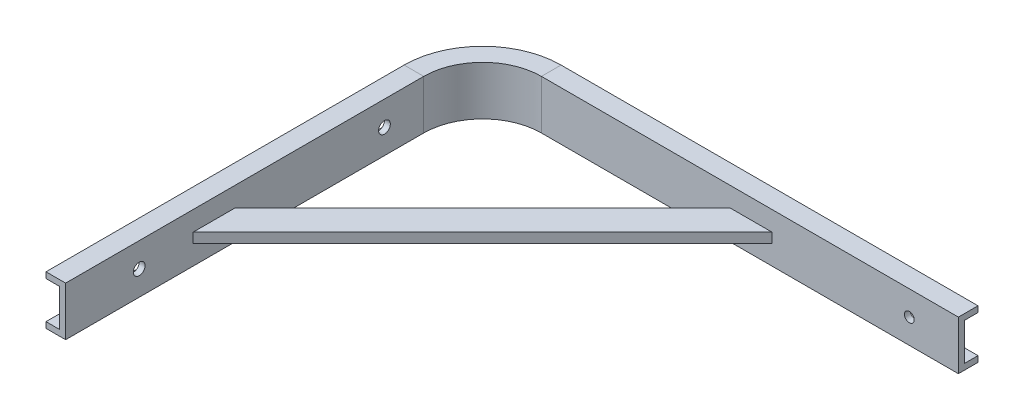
ISO-10303-21;
HEADER;
FILE_DESCRIPTION(('STEP AP214'),'2;1');
FILE_NAME('part.step','',(''),(''),'','','');
FILE_SCHEMA(('AUTOMOTIVE_DESIGN { 1 0 10303 214 1 1 1 1 }'));
ENDSEC;
DATA;
#1=APPLICATION_CONTEXT('core data for automotive mechanical design processes');
#2=APPLICATION_PROTOCOL_DEFINITION('international standard','automotive_design',2000,#1);
#3=PRODUCT_CONTEXT('',#1,'mechanical');
#4=PRODUCT('Part','Part','',(#3));
#5=PRODUCT_RELATED_PRODUCT_CATEGORY('part','',(#4));
#6=PRODUCT_DEFINITION_FORMATION('','',#4);
#7=PRODUCT_DEFINITION_CONTEXT('part definition',#1,'design');
#8=PRODUCT_DEFINITION('design','',#6,#7);
#9=PRODUCT_DEFINITION_SHAPE('','',#8);
#10=(LENGTH_UNIT() NAMED_UNIT(*) SI_UNIT(.MILLI.,.METRE.));
#11=(NAMED_UNIT(*) PLANE_ANGLE_UNIT() SI_UNIT($,.RADIAN.));
#12=(NAMED_UNIT(*) SI_UNIT($,.STERADIAN.) SOLID_ANGLE_UNIT());
#13=UNCERTAINTY_MEASURE_WITH_UNIT(LENGTH_MEASURE(1.E-05),#10,'distance_accuracy_value','');
#14=(GEOMETRIC_REPRESENTATION_CONTEXT(3) GLOBAL_UNCERTAINTY_ASSIGNED_CONTEXT((#13)) GLOBAL_UNIT_ASSIGNED_CONTEXT((#10,
#11,#12)) REPRESENTATION_CONTEXT('',''));
#15=CARTESIAN_POINT('',(0.,0.,0.));
#16=DIRECTION('',(0.,0.,1.));
#17=DIRECTION('',(1.,0.,0.));
#18=AXIS2_PLACEMENT_3D('',#15,#16,#17);
#19=CARTESIAN_POINT('',(-242.51106428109,-12.4999999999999,-227.488935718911));
#20=DIRECTION('',(-1.,0.,0.));
#21=DIRECTION('',(0.,0.,1.));
#22=AXIS2_PLACEMENT_3D('',#19,#20,#21);
#23=PLANE('',#22);
#24=CARTESIAN_POINT('',(-242.51106428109,0.,60.0000000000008));
#25=DIRECTION('',(1.,0.,0.));
#26=DIRECTION('',(0.,0.,-1.));
#27=AXIS2_PLACEMENT_3D('',#24,#25,#26);
#28=CIRCLE('',#27,3.00000000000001);
#29=CARTESIAN_POINT('',(-242.51106428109,0.,57.0000000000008));
#30=VERTEX_POINT('',#29);
#31=EDGE_CURVE('E254',#30,#30,#28,.T.);
#32=ORIENTED_EDGE('',*,*,#31,.F.);
#33=EDGE_LOOP('',(#32));
#34=FACE_BOUND('',#33,.T.);
#35=DIRECTION('',(0.,-1.,0.));
#36=VECTOR('',#35,1.);
#37=CARTESIAN_POINT('',(-242.511064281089,-12.4999999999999,40.0000000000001));
#38=LINE('',#37,#36);
#39=CARTESIAN_POINT('',(-242.511064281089,12.5,40.0000000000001));
#40=VERTEX_POINT('',#39);
#41=CARTESIAN_POINT('',(-242.511064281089,-12.5,40.0000000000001));
#42=VERTEX_POINT('',#41);
#43=EDGE_CURVE('E330',#40,#42,#38,.T.);
#44=ORIENTED_EDGE('',*,*,#43,.F.);
#45=DIRECTION('',(0.,0.,1.));
#46=VECTOR('',#45,1.);
#47=CARTESIAN_POINT('',(-242.51106428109,12.4999999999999,-227.488935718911));
#48=LINE('',#47,#46);
#49=CARTESIAN_POINT('',(-242.511064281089,12.5,222.511064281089));
#50=VERTEX_POINT('',#49);
#51=EDGE_CURVE('E312',#40,#50,#48,.T.);
#52=ORIENTED_EDGE('',*,*,#51,.T.);
#53=DIRECTION('',(0.,-1.,0.));
#54=VECTOR('',#53,1.);
#55=CARTESIAN_POINT('',(-242.511064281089,12.5,222.511064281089));
#56=LINE('',#55,#54);
#57=CARTESIAN_POINT('',(-242.511064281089,-12.5,222.511064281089));
#58=VERTEX_POINT('',#57);
#59=EDGE_CURVE('E309',#50,#58,#56,.T.);
#60=ORIENTED_EDGE('',*,*,#59,.T.);
#61=DIRECTION('',(0.,0.,-1.));
#62=VECTOR('',#61,1.);
#63=CARTESIAN_POINT('',(-242.51106428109,-12.4999999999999,-227.488935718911));
#64=LINE('',#63,#62);
#65=EDGE_CURVE('E311',#58,#42,#64,.T.);
#66=ORIENTED_EDGE('',*,*,#65,.T.);
#67=EDGE_LOOP('',(#44,#52,#60,#66));
#68=FACE_BOUND('',#67,.T.);
#69=CARTESIAN_POINT('',(-242.511064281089,0.,185.000000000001));
#70=DIRECTION('',(1.,0.,0.));
#71=DIRECTION('',(0.,0.,-1.));
#72=AXIS2_PLACEMENT_3D('',#69,#70,#71);
#73=CIRCLE('',#72,2.99999999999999);
#74=CARTESIAN_POINT('',(-242.511064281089,0.,182.000000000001));
#75=VERTEX_POINT('',#74);
#76=EDGE_CURVE('E257',#75,#75,#73,.T.);
#77=ORIENTED_EDGE('',*,*,#76,.F.);
#78=EDGE_LOOP('',(#77));
#79=FACE_BOUND('',#78,.T.);
#80=DIRECTION('',(0.,0.,1.));
#81=VECTOR('',#80,1.);
#82=CARTESIAN_POINT('',(-242.511064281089,2.5,157.511064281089));
#83=LINE('',#82,#81);
#84=CARTESIAN_POINT('',(-242.511064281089,2.5,136.297860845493));
#85=VERTEX_POINT('',#84);
#86=CARTESIAN_POINT('',(-242.511064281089,2.5,157.511064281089));
#87=VERTEX_POINT('',#86);
#88=EDGE_CURVE('E180',#85,#87,#83,.T.);
#89=ORIENTED_EDGE('',*,*,#88,.F.);
#90=DIRECTION('',(0.,-1.,0.));
#91=VECTOR('',#90,1.);
#92=CARTESIAN_POINT('',(-242.511064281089,2.5,136.297860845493));
#93=LINE('',#92,#91);
#94=CARTESIAN_POINT('',(-242.511064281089,-2.5,136.297860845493));
#95=VERTEX_POINT('',#94);
#96=EDGE_CURVE('E433',#85,#95,#93,.T.);
#97=ORIENTED_EDGE('',*,*,#96,.T.);
#98=DIRECTION('',(0.,0.,1.));
#99=VECTOR('',#98,1.);
#100=CARTESIAN_POINT('',(-242.511064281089,-2.5,157.511064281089));
#101=LINE('',#100,#99);
#102=CARTESIAN_POINT('',(-242.511064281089,-2.5,157.511064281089));
#103=VERTEX_POINT('',#102);
#104=EDGE_CURVE('E191',#95,#103,#101,.T.);
#105=ORIENTED_EDGE('',*,*,#104,.T.);
#106=DIRECTION('',(0.,-1.,0.));
#107=VECTOR('',#106,1.);
#108=CARTESIAN_POINT('',(-242.511064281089,2.5,157.511064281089));
#109=LINE('',#108,#107);
#110=EDGE_CURVE('E51',#87,#103,#109,.T.);
#111=ORIENTED_EDGE('',*,*,#110,.F.);
#112=EDGE_LOOP('',(#89,#97,#105,#111));
#113=FACE_BOUND('',#112,.T.);
#114=ADVANCED_FACE('F34',(#34,#68,#79,#113),#23,.F.);
#115=CARTESIAN_POINT('',(0.,-12.4999999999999,10.));
#116=DIRECTION('',(0.,0.,-1.));
#117=DIRECTION('',(-1.,0.,0.));
#118=AXIS2_PLACEMENT_3D('',#115,#116,#117);
#119=PLANE('',#118);
#120=DIRECTION('',(-1.,0.,0.));
#121=VECTOR('',#120,1.);
#122=CARTESIAN_POINT('',(0.,12.4999999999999,10.));
#123=LINE('',#122,#121);
#124=CARTESIAN_POINT('',(0.,12.4999999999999,10.));
#125=VERTEX_POINT('',#124);
#126=CARTESIAN_POINT('',(-212.511064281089,12.5,9.99999999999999));
#127=VERTEX_POINT('',#126);
#128=EDGE_CURVE('E296',#125,#127,#123,.T.);
#129=ORIENTED_EDGE('',*,*,#128,.T.);
#130=DIRECTION('',(0.,-1.,0.));
#131=VECTOR('',#130,1.);
#132=CARTESIAN_POINT('',(-212.511064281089,-12.4999999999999,10.));
#133=LINE('',#132,#131);
#134=CARTESIAN_POINT('',(-212.511064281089,-12.5,9.99999999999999));
#135=VERTEX_POINT('',#134);
#136=EDGE_CURVE('E293',#127,#135,#133,.T.);
#137=ORIENTED_EDGE('',*,*,#136,.T.);
#138=DIRECTION('',(1.,0.,0.));
#139=VECTOR('',#138,1.);
#140=CARTESIAN_POINT('',(0.,-12.4999999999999,10.));
#141=LINE('',#140,#139);
#142=CARTESIAN_POINT('',(0.,-12.4999999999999,10.));
#143=VERTEX_POINT('',#142);
#144=EDGE_CURVE('E291',#135,#143,#141,.T.);
#145=ORIENTED_EDGE('',*,*,#144,.T.);
#146=DIRECTION('',(0.,1.,0.));
#147=VECTOR('',#146,1.);
#148=CARTESIAN_POINT('',(0.,12.4999999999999,10.));
#149=LINE('',#148,#147);
#150=EDGE_CURVE('E288',#143,#125,#149,.T.);
#151=ORIENTED_EDGE('',*,*,#150,.T.);
#152=EDGE_LOOP('',(#129,#137,#145,#151));
#153=FACE_BOUND('',#152,.T.);
#154=CARTESIAN_POINT('',(-25.,0.,10.));
#155=DIRECTION('',(0.,0.,1.));
#156=DIRECTION('',(1.,0.,0.));
#157=AXIS2_PLACEMENT_3D('',#154,#155,#156);
#158=CIRCLE('',#157,2.5);
#159=CARTESIAN_POINT('',(-22.5,0.,10.));
#160=VERTEX_POINT('',#159);
#161=EDGE_CURVE('E251',#160,#160,#158,.T.);
#162=ORIENTED_EDGE('',*,*,#161,.F.);
#163=EDGE_LOOP('',(#162));
#164=FACE_BOUND('',#163,.T.);
#165=DIRECTION('',(-1.,0.,0.));
#166=VECTOR('',#165,1.);
#167=CARTESIAN_POINT('',(-116.213203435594,2.5,10.));
#168=LINE('',#167,#166);
#169=CARTESIAN_POINT('',(-94.9999999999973,2.5,10.));
#170=VERTEX_POINT('',#169);
#171=CARTESIAN_POINT('',(-116.213203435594,2.5,10.));
#172=VERTEX_POINT('',#171);
#173=EDGE_CURVE('E179',#170,#172,#168,.T.);
#174=ORIENTED_EDGE('',*,*,#173,.F.);
#175=DIRECTION('',(0.,-1.,0.));
#176=VECTOR('',#175,1.);
#177=CARTESIAN_POINT('',(-94.9999999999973,2.5,10.));
#178=LINE('',#177,#176);
#179=CARTESIAN_POINT('',(-94.9999999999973,-2.5,10.));
#180=VERTEX_POINT('',#179);
#181=EDGE_CURVE('E176',#170,#180,#178,.T.);
#182=ORIENTED_EDGE('',*,*,#181,.T.);
#183=DIRECTION('',(-1.,0.,0.));
#184=VECTOR('',#183,1.);
#185=CARTESIAN_POINT('',(-116.213203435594,-2.5,10.));
#186=LINE('',#185,#184);
#187=CARTESIAN_POINT('',(-116.213203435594,-2.5,10.));
#188=VERTEX_POINT('',#187);
#189=EDGE_CURVE('E439',#180,#188,#186,.T.);
#190=ORIENTED_EDGE('',*,*,#189,.T.);
#191=DIRECTION('',(0.,-1.,0.));
#192=VECTOR('',#191,1.);
#193=CARTESIAN_POINT('',(-116.213203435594,2.5,10.));
#194=LINE('',#193,#192);
#195=EDGE_CURVE('E196',#172,#188,#194,.T.);
#196=ORIENTED_EDGE('',*,*,#195,.F.);
#197=EDGE_LOOP('',(#174,#182,#190,#196));
#198=FACE_BOUND('',#197,.T.);
#199=ADVANCED_FACE('F424',(#153,#164,#198),#119,.F.);
#200=CARTESIAN_POINT('',(-252.51106428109,-12.4999999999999,-227.488935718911));
#201=DIRECTION('',(-1.,0.,0.));
#202=DIRECTION('',(0.,0.,1.));
#203=AXIS2_PLACEMENT_3D('',#200,#201,#202);
#204=PLANE('',#203);
#205=DIRECTION('',(0.,-1.,0.));
#206=VECTOR('',#205,1.);
#207=CARTESIAN_POINT('',(-252.511064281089,12.5,222.511064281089));
#208=LINE('',#207,#206);
#209=CARTESIAN_POINT('',(-252.511064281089,-9.5,222.511064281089));
#210=VERTEX_POINT('',#209);
#211=CARTESIAN_POINT('',(-252.511064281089,-12.5,222.511064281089));
#212=VERTEX_POINT('',#211);
#213=EDGE_CURVE('E317',#210,#212,#208,.T.);
#214=ORIENTED_EDGE('',*,*,#213,.F.);
#215=DIRECTION('',(0.,0.,1.));
#216=VECTOR('',#215,1.);
#217=CARTESIAN_POINT('',(-252.511064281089,-9.5,40.0000000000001));
#218=LINE('',#217,#216);
#219=CARTESIAN_POINT('',(-252.511064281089,-9.5,40.0000000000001));
#220=VERTEX_POINT('',#219);
#221=EDGE_CURVE('E194',#220,#210,#218,.T.);
#222=ORIENTED_EDGE('',*,*,#221,.F.);
#223=DIRECTION('',(0.,-1.,0.));
#224=VECTOR('',#223,1.);
#225=CARTESIAN_POINT('',(-252.511064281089,-12.4999999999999,40.0000000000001));
#226=LINE('',#225,#224);
#227=CARTESIAN_POINT('',(-252.511064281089,-12.5,40.0000000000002));
#228=VERTEX_POINT('',#227);
#229=EDGE_CURVE('E43',#220,#228,#226,.T.);
#230=ORIENTED_EDGE('',*,*,#229,.T.);
#231=DIRECTION('',(0.,0.,-1.));
#232=VECTOR('',#231,1.);
#233=CARTESIAN_POINT('',(-252.51106428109,-12.4999999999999,-227.488935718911));
#234=LINE('',#233,#232);
#235=EDGE_CURVE('E316',#212,#228,#234,.T.);
#236=ORIENTED_EDGE('',*,*,#235,.F.);
#237=EDGE_LOOP('',(#214,#222,#230,#236));
#238=FACE_BOUND('',#237,.T.);
#239=ADVANCED_FACE('F398',(#238),#204,.T.);
#240=CARTESIAN_POINT('',(0.,-12.4999999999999,0.));
#241=DIRECTION('',(0.,0.,-1.));
#242=DIRECTION('',(-1.,0.,0.));
#243=AXIS2_PLACEMENT_3D('',#240,#241,#242);
#244=PLANE('',#243);
#245=DIRECTION('',(0.,-1.,0.));
#246=VECTOR('',#245,1.);
#247=CARTESIAN_POINT('',(-212.511064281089,-12.4999999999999,0.));
#248=LINE('',#247,#246);
#249=CARTESIAN_POINT('',(-212.511064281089,-9.50000000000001,0.));
#250=VERTEX_POINT('',#249);
#251=CARTESIAN_POINT('',(-212.511064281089,-12.5,0.));
#252=VERTEX_POINT('',#251);
#253=EDGE_CURVE('E264',#250,#252,#248,.T.);
#254=ORIENTED_EDGE('',*,*,#253,.F.);
#255=DIRECTION('',(-1.,0.,0.));
#256=VECTOR('',#255,1.);
#257=CARTESIAN_POINT('',(0.,-9.5,0.));
#258=LINE('',#257,#256);
#259=CARTESIAN_POINT('',(0.,-9.5,0.));
#260=VERTEX_POINT('',#259);
#261=EDGE_CURVE('E215',#260,#250,#258,.T.);
#262=ORIENTED_EDGE('',*,*,#261,.F.);
#263=DIRECTION('',(0.,1.,0.));
#264=VECTOR('',#263,1.);
#265=CARTESIAN_POINT('',(0.,12.4999999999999,0.));
#266=LINE('',#265,#264);
#267=CARTESIAN_POINT('',(0.,-12.4999999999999,0.));
#268=VERTEX_POINT('',#267);
#269=EDGE_CURVE('E302',#268,#260,#266,.T.);
#270=ORIENTED_EDGE('',*,*,#269,.F.);
#271=DIRECTION('',(1.,0.,0.));
#272=VECTOR('',#271,1.);
#273=CARTESIAN_POINT('',(0.,-12.4999999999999,0.));
#274=LINE('',#273,#272);
#275=EDGE_CURVE('E283',#252,#268,#274,.T.);
#276=ORIENTED_EDGE('',*,*,#275,.F.);
#277=EDGE_LOOP('',(#254,#262,#270,#276));
#278=FACE_BOUND('',#277,.T.);
#279=ADVANCED_FACE('F414',(#278),#244,.T.);
#280=CARTESIAN_POINT('',(-212.511064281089,463.304835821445,40.));
#281=DIRECTION('',(0.,-1.,0.));
#282=DIRECTION('',(0.,0.,-1.));
#283=AXIS2_PLACEMENT_3D('',#280,#281,#282);
#284=CYLINDRICAL_SURFACE('',#283,40.);
#285=ORIENTED_EDGE('',*,*,#229,.F.);
#286=CARTESIAN_POINT('',(-212.511064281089,-9.5,40.));
#287=DIRECTION('',(0.,1.,0.));
#288=DIRECTION('',(0.,0.,1.));
#289=AXIS2_PLACEMENT_3D('',#286,#287,#288);
#290=CIRCLE('',#289,40.);
#291=EDGE_CURVE('E192',#250,#220,#290,.T.);
#292=ORIENTED_EDGE('',*,*,#291,.F.);
#293=ORIENTED_EDGE('',*,*,#253,.T.);
#294=CARTESIAN_POINT('',(-212.511064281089,-12.5,40.));
#295=DIRECTION('',(0.,-1.,0.));
#296=DIRECTION('',(0.,0.,-1.));
#297=AXIS2_PLACEMENT_3D('',#294,#295,#296);
#298=CIRCLE('',#297,40.);
#299=EDGE_CURVE('E261',#228,#252,#298,.T.);
#300=ORIENTED_EDGE('',*,*,#299,.F.);
#301=EDGE_LOOP('',(#285,#292,#293,#300));
#302=FACE_BOUND('',#301,.T.);
#303=ADVANCED_FACE('F408',(#302),#284,.T.);
#304=CARTESIAN_POINT('',(-252.511064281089,0.,185.000000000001));
#305=DIRECTION('',(1.,0.,0.));
#306=DIRECTION('',(0.,0.,-1.));
#307=AXIS2_PLACEMENT_3D('',#304,#305,#306);
#308=CYLINDRICAL_SURFACE('',#307,2.99999999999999);
#309=ORIENTED_EDGE('',*,*,#76,.T.);
#310=EDGE_LOOP('',(#309));
#311=FACE_BOUND('',#310,.T.);
#312=CARTESIAN_POINT('',(-245.511064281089,0.,185.000000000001));
#313=DIRECTION('',(-1.,0.,0.));
#314=DIRECTION('',(0.,0.,1.));
#315=AXIS2_PLACEMENT_3D('',#312,#313,#314);
#316=CIRCLE('',#315,2.99999999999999);
#317=CARTESIAN_POINT('',(-245.511064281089,0.,188.000000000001));
#318=VERTEX_POINT('',#317);
#319=EDGE_CURVE('E248',#318,#318,#316,.T.);
#320=ORIENTED_EDGE('',*,*,#319,.T.);
#321=EDGE_LOOP('',(#320));
#322=FACE_BOUND('',#321,.T.);
#323=ADVANCED_FACE('F480',(#311,#322),#308,.F.);
#324=CARTESIAN_POINT('',(-252.51106428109,0.,60.0000000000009));
#325=DIRECTION('',(1.,0.,0.));
#326=DIRECTION('',(0.,0.,-1.));
#327=AXIS2_PLACEMENT_3D('',#324,#325,#326);
#328=CYLINDRICAL_SURFACE('',#327,3.00000000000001);
#329=ORIENTED_EDGE('',*,*,#31,.T.);
#330=EDGE_LOOP('',(#329));
#331=FACE_BOUND('',#330,.T.);
#332=CARTESIAN_POINT('',(-245.511064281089,0.,60.0000000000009));
#333=DIRECTION('',(-1.,0.,0.));
#334=DIRECTION('',(0.,0.,1.));
#335=AXIS2_PLACEMENT_3D('',#332,#333,#334);
#336=CIRCLE('',#335,3.00000000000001);
#337=CARTESIAN_POINT('',(-245.511064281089,0.,63.0000000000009));
#338=VERTEX_POINT('',#337);
#339=EDGE_CURVE('E38',#338,#338,#336,.T.);
#340=ORIENTED_EDGE('',*,*,#339,.T.);
#341=EDGE_LOOP('',(#340));
#342=FACE_BOUND('',#341,.T.);
#343=ADVANCED_FACE('F344',(#331,#342),#328,.F.);
#344=CARTESIAN_POINT('',(-25.,0.,0.));
#345=DIRECTION('',(0.,0.,1.));
#346=DIRECTION('',(1.,0.,0.));
#347=AXIS2_PLACEMENT_3D('',#344,#345,#346);
#348=CYLINDRICAL_SURFACE('',#347,2.5);
#349=ORIENTED_EDGE('',*,*,#161,.T.);
#350=EDGE_LOOP('',(#349));
#351=FACE_BOUND('',#350,.T.);
#352=CARTESIAN_POINT('',(-25.,0.,7.));
#353=DIRECTION('',(0.,0.,-1.));
#354=DIRECTION('',(-1.,0.,0.));
#355=AXIS2_PLACEMENT_3D('',#352,#353,#354);
#356=CIRCLE('',#355,2.5);
#357=CARTESIAN_POINT('',(-27.5,0.,7.));
#358=VERTEX_POINT('',#357);
#359=EDGE_CURVE('E247',#358,#358,#356,.F.);
#360=ORIENTED_EDGE('',*,*,#359,.F.);
#361=EDGE_LOOP('',(#360));
#362=FACE_BOUND('',#361,.T.);
#363=ADVANCED_FACE('F464',(#351,#362),#348,.F.);
#364=DIRECTION('',(0.,0.,1.));
#365=VECTOR('',#364,1.);
#366=CARTESIAN_POINT('',(-252.511064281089,9.5,40.0000000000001));
#367=LINE('',#366,#365);
#368=CARTESIAN_POINT('',(-252.511064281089,9.5,40.0000000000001));
#369=VERTEX_POINT('',#368);
#370=CARTESIAN_POINT('',(-252.511064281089,9.5,222.511064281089));
#371=VERTEX_POINT('',#370);
#372=EDGE_CURVE('E220',#369,#371,#367,.T.);
#373=ORIENTED_EDGE('',*,*,#372,.T.);
#374=CARTESIAN_POINT('',(-252.511064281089,12.5,222.511064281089));
#375=VERTEX_POINT('',#374);
#376=EDGE_CURVE('E313',#375,#371,#208,.T.);
#377=ORIENTED_EDGE('',*,*,#376,.F.);
#378=DIRECTION('',(0.,0.,1.));
#379=VECTOR('',#378,1.);
#380=CARTESIAN_POINT('',(-252.51106428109,12.4999999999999,-227.488935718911));
#381=LINE('',#380,#379);
#382=CARTESIAN_POINT('',(-252.511064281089,12.5,40.0000000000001));
#383=VERTEX_POINT('',#382);
#384=EDGE_CURVE('E276',#383,#375,#381,.T.);
#385=ORIENTED_EDGE('',*,*,#384,.F.);
#386=EDGE_CURVE('E11',#383,#369,#226,.T.);
#387=ORIENTED_EDGE('',*,*,#386,.T.);
#388=EDGE_LOOP('',(#373,#377,#385,#387));
#389=FACE_BOUND('',#388,.T.);
#390=ADVANCED_FACE('F367',(#389),#204,.T.);
#391=CARTESIAN_POINT('',(-242.51106428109,12.4999999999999,-227.488935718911));
#392=DIRECTION('',(0.,-1.,0.));
#393=DIRECTION('',(0.,0.,-1.));
#394=AXIS2_PLACEMENT_3D('',#391,#392,#393);
#395=PLANE('',#394);
#396=DIRECTION('',(1.,0.,0.));
#397=VECTOR('',#396,1.);
#398=CARTESIAN_POINT('',(-242.511064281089,12.5,40.0000000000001));
#399=LINE('',#398,#397);
#400=EDGE_CURVE('E324',#383,#40,#399,.T.);
#401=ORIENTED_EDGE('',*,*,#400,.F.);
#402=ORIENTED_EDGE('',*,*,#384,.T.);
#403=DIRECTION('',(-1.,0.,0.));
#404=VECTOR('',#403,1.);
#405=CARTESIAN_POINT('',(-242.511064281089,12.5,222.511064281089));
#406=LINE('',#405,#404);
#407=EDGE_CURVE('E321',#50,#375,#406,.T.);
#408=ORIENTED_EDGE('',*,*,#407,.F.);
#409=ORIENTED_EDGE('',*,*,#51,.F.);
#410=EDGE_LOOP('',(#401,#402,#408,#409));
#411=FACE_BOUND('',#410,.T.);
#412=ADVANCED_FACE('F36',(#411),#395,.F.);
#413=CARTESIAN_POINT('',(-242.511064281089,12.5,222.511064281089));
#414=DIRECTION('',(0.,0.,-1.));
#415=DIRECTION('',(-1.,0.,0.));
#416=AXIS2_PLACEMENT_3D('',#413,#414,#415);
#417=PLANE('',#416);
#418=ORIENTED_EDGE('',*,*,#376,.T.);
#419=DIRECTION('',(1.,0.,0.));
#420=VECTOR('',#419,1.);
#421=CARTESIAN_POINT('',(-245.511064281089,9.5,222.511064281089));
#422=LINE('',#421,#420);
#423=CARTESIAN_POINT('',(-245.511064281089,9.5,222.511064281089));
#424=VERTEX_POINT('',#423);
#425=EDGE_CURVE('E223',#371,#424,#422,.T.);
#426=ORIENTED_EDGE('',*,*,#425,.T.);
#427=DIRECTION('',(0.,-1.,0.));
#428=VECTOR('',#427,1.);
#429=CARTESIAN_POINT('',(-245.511064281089,9.5,222.511064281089));
#430=LINE('',#429,#428);
#431=CARTESIAN_POINT('',(-245.511064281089,-9.5,222.511064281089));
#432=VERTEX_POINT('',#431);
#433=EDGE_CURVE('E244',#424,#432,#430,.T.);
#434=ORIENTED_EDGE('',*,*,#433,.T.);
#435=DIRECTION('',(1.,0.,0.));
#436=VECTOR('',#435,1.);
#437=CARTESIAN_POINT('',(-245.511064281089,-9.5,222.511064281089));
#438=LINE('',#437,#436);
#439=EDGE_CURVE('E201',#210,#432,#438,.T.);
#440=ORIENTED_EDGE('',*,*,#439,.F.);
#441=ORIENTED_EDGE('',*,*,#213,.T.);
#442=DIRECTION('',(-1.,0.,0.));
#443=VECTOR('',#442,1.);
#444=CARTESIAN_POINT('',(-242.511064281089,-12.5,222.511064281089));
#445=LINE('',#444,#443);
#446=EDGE_CURVE('E318',#58,#212,#445,.T.);
#447=ORIENTED_EDGE('',*,*,#446,.F.);
#448=ORIENTED_EDGE('',*,*,#59,.F.);
#449=ORIENTED_EDGE('',*,*,#407,.T.);
#450=EDGE_LOOP('',(#418,#426,#434,#440,#441,#447,#448,#449));
#451=FACE_BOUND('',#450,.T.);
#452=ADVANCED_FACE('F361',(#451),#417,.F.);
#453=CARTESIAN_POINT('',(-242.51106428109,-12.4999999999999,-227.488935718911));
#454=DIRECTION('',(0.,1.,0.));
#455=DIRECTION('',(0.,0.,1.));
#456=AXIS2_PLACEMENT_3D('',#453,#454,#455);
#457=PLANE('',#456);
#458=DIRECTION('',(-1.,0.,0.));
#459=VECTOR('',#458,1.);
#460=CARTESIAN_POINT('',(-242.511064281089,-12.5,40.0000000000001));
#461=LINE('',#460,#459);
#462=EDGE_CURVE('E327',#42,#228,#461,.T.);
#463=ORIENTED_EDGE('',*,*,#462,.F.);
#464=ORIENTED_EDGE('',*,*,#65,.F.);
#465=ORIENTED_EDGE('',*,*,#446,.T.);
#466=ORIENTED_EDGE('',*,*,#235,.T.);
#467=EDGE_LOOP('',(#463,#464,#465,#466));
#468=FACE_BOUND('',#467,.T.);
#469=ADVANCED_FACE('F401',(#468),#457,.F.);
#470=CARTESIAN_POINT('',(0.,12.4999999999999,10.));
#471=DIRECTION('',(-1.,0.,0.));
#472=DIRECTION('',(0.,0.,1.));
#473=AXIS2_PLACEMENT_3D('',#470,#471,#472);
#474=PLANE('',#473);
#475=DIRECTION('',(0.,-1.,0.));
#476=VECTOR('',#475,1.);
#477=CARTESIAN_POINT('',(0.,9.5,7.));
#478=LINE('',#477,#476);
#479=CARTESIAN_POINT('',(0.,9.5,7.));
#480=VERTEX_POINT('',#479);
#481=CARTESIAN_POINT('',(0.,-9.5,7.));
#482=VERTEX_POINT('',#481);
#483=EDGE_CURVE('E238',#480,#482,#478,.T.);
#484=ORIENTED_EDGE('',*,*,#483,.F.);
#485=DIRECTION('',(0.,0.,-1.));
#486=VECTOR('',#485,1.);
#487=CARTESIAN_POINT('',(0.,9.5,0.));
#488=LINE('',#487,#486);
#489=CARTESIAN_POINT('',(0.,9.5,0.));
#490=VERTEX_POINT('',#489);
#491=EDGE_CURVE('E232',#480,#490,#488,.T.);
#492=ORIENTED_EDGE('',*,*,#491,.T.);
#493=CARTESIAN_POINT('',(0.,12.4999999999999,0.));
#494=VERTEX_POINT('',#493);
#495=EDGE_CURVE('E305',#490,#494,#266,.T.);
#496=ORIENTED_EDGE('',*,*,#495,.T.);
#497=DIRECTION('',(0.,0.,-1.));
#498=VECTOR('',#497,1.);
#499=CARTESIAN_POINT('',(0.,12.4999999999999,10.));
#500=LINE('',#499,#498);
#501=EDGE_CURVE('E273',#125,#494,#500,.T.);
#502=ORIENTED_EDGE('',*,*,#501,.F.);
#503=ORIENTED_EDGE('',*,*,#150,.F.);
#504=DIRECTION('',(0.,0.,-1.));
#505=VECTOR('',#504,1.);
#506=CARTESIAN_POINT('',(0.,-12.4999999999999,10.));
#507=LINE('',#506,#505);
#508=EDGE_CURVE('E299',#143,#268,#507,.T.);
#509=ORIENTED_EDGE('',*,*,#508,.T.);
#510=ORIENTED_EDGE('',*,*,#269,.T.);
#511=DIRECTION('',(0.,0.,-1.));
#512=VECTOR('',#511,1.);
#513=CARTESIAN_POINT('',(0.,-9.5,0.));
#514=LINE('',#513,#512);
#515=EDGE_CURVE('E213',#482,#260,#514,.T.);
#516=ORIENTED_EDGE('',*,*,#515,.F.);
#517=EDGE_LOOP('',(#484,#492,#496,#502,#503,#509,#510,#516));
#518=FACE_BOUND('',#517,.T.);
#519=ADVANCED_FACE('F383',(#518),#474,.F.);
#520=CARTESIAN_POINT('',(0.,-12.4999999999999,10.));
#521=DIRECTION('',(0.,1.,0.));
#522=DIRECTION('',(-1.,0.,0.));
#523=AXIS2_PLACEMENT_3D('',#520,#521,#522);
#524=PLANE('',#523);
#525=ORIENTED_EDGE('',*,*,#144,.F.);
#526=DIRECTION('',(0.,0.,-1.));
#527=VECTOR('',#526,1.);
#528=CARTESIAN_POINT('',(-212.511064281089,-12.5,10.));
#529=LINE('',#528,#527);
#530=EDGE_CURVE('E285',#135,#252,#529,.T.);
#531=ORIENTED_EDGE('',*,*,#530,.T.);
#532=ORIENTED_EDGE('',*,*,#275,.T.);
#533=ORIENTED_EDGE('',*,*,#508,.F.);
#534=EDGE_LOOP('',(#525,#531,#532,#533));
#535=FACE_BOUND('',#534,.T.);
#536=ADVANCED_FACE('F419',(#535),#524,.F.);
#537=DIRECTION('',(-1.,0.,0.));
#538=VECTOR('',#537,1.);
#539=CARTESIAN_POINT('',(0.,9.5,0.));
#540=LINE('',#539,#538);
#541=CARTESIAN_POINT('',(-212.511064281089,9.5,0.));
#542=VERTEX_POINT('',#541);
#543=EDGE_CURVE('E235',#490,#542,#540,.T.);
#544=ORIENTED_EDGE('',*,*,#543,.T.);
#545=CARTESIAN_POINT('',(-212.511064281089,12.5,0.));
#546=VERTEX_POINT('',#545);
#547=EDGE_CURVE('E306',#546,#542,#248,.T.);
#548=ORIENTED_EDGE('',*,*,#547,.F.);
#549=DIRECTION('',(-1.,0.,0.));
#550=VECTOR('',#549,1.);
#551=CARTESIAN_POINT('',(0.,12.4999999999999,0.));
#552=LINE('',#551,#550);
#553=EDGE_CURVE('E280',#494,#546,#552,.T.);
#554=ORIENTED_EDGE('',*,*,#553,.F.);
#555=ORIENTED_EDGE('',*,*,#495,.F.);
#556=EDGE_LOOP('',(#544,#548,#554,#555));
#557=FACE_BOUND('',#556,.T.);
#558=ADVANCED_FACE('F375',(#557),#244,.T.);
#559=CARTESIAN_POINT('',(0.,12.4999999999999,10.));
#560=DIRECTION('',(0.,-1.,0.));
#561=DIRECTION('',(1.,0.,0.));
#562=AXIS2_PLACEMENT_3D('',#559,#560,#561);
#563=PLANE('',#562);
#564=ORIENTED_EDGE('',*,*,#553,.T.);
#565=DIRECTION('',(0.,0.,1.));
#566=VECTOR('',#565,1.);
#567=CARTESIAN_POINT('',(-212.511064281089,12.5,10.));
#568=LINE('',#567,#566);
#569=EDGE_CURVE('E277',#546,#127,#568,.T.);
#570=ORIENTED_EDGE('',*,*,#569,.T.);
#571=ORIENTED_EDGE('',*,*,#128,.F.);
#572=ORIENTED_EDGE('',*,*,#501,.T.);
#573=EDGE_LOOP('',(#564,#570,#571,#572));
#574=FACE_BOUND('',#573,.T.);
#575=ADVANCED_FACE('F378',(#574),#563,.F.);
#576=CARTESIAN_POINT('',(-212.511064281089,12.5,40.));
#577=DIRECTION('',(0.,-1.,0.));
#578=DIRECTION('',(1.,0.,0.));
#579=AXIS2_PLACEMENT_3D('',#576,#577,#578);
#580=PLANE('',#579);
#581=ORIENTED_EDGE('',*,*,#400,.T.);
#582=CARTESIAN_POINT('',(-212.511064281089,12.5,40.));
#583=DIRECTION('',(0.,-1.,0.));
#584=DIRECTION('',(0.,0.,-1.));
#585=AXIS2_PLACEMENT_3D('',#582,#583,#584);
#586=CIRCLE('',#585,30.);
#587=EDGE_CURVE('E260',#127,#40,#586,.F.);
#588=ORIENTED_EDGE('',*,*,#587,.F.);
#589=ORIENTED_EDGE('',*,*,#569,.F.);
#590=CARTESIAN_POINT('',(-212.511064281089,12.5,40.));
#591=DIRECTION('',(0.,-1.,0.));
#592=DIRECTION('',(0.,0.,-1.));
#593=AXIS2_PLACEMENT_3D('',#590,#591,#592);
#594=CIRCLE('',#593,40.);
#595=EDGE_CURVE('E265',#546,#383,#594,.F.);
#596=ORIENTED_EDGE('',*,*,#595,.T.);
#597=EDGE_LOOP('',(#581,#588,#589,#596));
#598=FACE_BOUND('',#597,.T.);
#599=ADVANCED_FACE('F488',(#598),#580,.F.);
#600=CARTESIAN_POINT('',(-212.511064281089,-12.5,40.));
#601=DIRECTION('',(0.,1.,0.));
#602=DIRECTION('',(-1.,0.,0.));
#603=AXIS2_PLACEMENT_3D('',#600,#601,#602);
#604=PLANE('',#603);
#605=ORIENTED_EDGE('',*,*,#530,.F.);
#606=CARTESIAN_POINT('',(-212.511064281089,-12.5,40.));
#607=DIRECTION('',(0.,-1.,0.));
#608=DIRECTION('',(0.,0.,-1.));
#609=AXIS2_PLACEMENT_3D('',#606,#607,#608);
#610=CIRCLE('',#609,30.);
#611=EDGE_CURVE('E268',#42,#135,#610,.T.);
#612=ORIENTED_EDGE('',*,*,#611,.F.);
#613=ORIENTED_EDGE('',*,*,#462,.T.);
#614=ORIENTED_EDGE('',*,*,#299,.T.);
#615=EDGE_LOOP('',(#605,#612,#613,#614));
#616=FACE_BOUND('',#615,.T.);
#617=ADVANCED_FACE('F406',(#616),#604,.F.);
#618=CARTESIAN_POINT('',(-212.511064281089,9.5,40.));
#619=DIRECTION('',(0.,1.,0.));
#620=DIRECTION('',(0.,0.,1.));
#621=AXIS2_PLACEMENT_3D('',#618,#619,#620);
#622=CIRCLE('',#621,40.);
#623=EDGE_CURVE('E217',#542,#369,#622,.T.);
#624=ORIENTED_EDGE('',*,*,#623,.T.);
#625=ORIENTED_EDGE('',*,*,#386,.F.);
#626=ORIENTED_EDGE('',*,*,#595,.F.);
#627=ORIENTED_EDGE('',*,*,#547,.T.);
#628=EDGE_LOOP('',(#624,#625,#626,#627));
#629=FACE_BOUND('',#628,.T.);
#630=ADVANCED_FACE('F370',(#629),#284,.T.);
#631=CARTESIAN_POINT('',(-212.511064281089,463.304835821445,40.));
#632=DIRECTION('',(0.,-1.,0.));
#633=DIRECTION('',(0.,0.,-1.));
#634=AXIS2_PLACEMENT_3D('',#631,#632,#633);
#635=CYLINDRICAL_SURFACE('',#634,30.);
#636=ORIENTED_EDGE('',*,*,#611,.T.);
#637=ORIENTED_EDGE('',*,*,#136,.F.);
#638=ORIENTED_EDGE('',*,*,#587,.T.);
#639=ORIENTED_EDGE('',*,*,#43,.T.);
#640=EDGE_LOOP('',(#636,#637,#638,#639));
#641=FACE_BOUND('',#640,.T.);
#642=ADVANCED_FACE('F421',(#641),#635,.F.);
#643=CARTESIAN_POINT('',(0.,9.5,7.));
#644=DIRECTION('',(0.,0.,-1.));
#645=DIRECTION('',(-1.,0.,0.));
#646=AXIS2_PLACEMENT_3D('',#643,#644,#645);
#647=PLANE('',#646);
#648=DIRECTION('',(0.,-1.,0.));
#649=VECTOR('',#648,1.);
#650=CARTESIAN_POINT('',(-212.511064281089,9.5,7.));
#651=LINE('',#650,#649);
#652=CARTESIAN_POINT('',(-212.511064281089,9.5,7.));
#653=VERTEX_POINT('',#652);
#654=CARTESIAN_POINT('',(-212.511064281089,-9.5,7.));
#655=VERTEX_POINT('',#654);
#656=EDGE_CURVE('E240',#653,#655,#651,.T.);
#657=ORIENTED_EDGE('',*,*,#656,.F.);
#658=DIRECTION('',(1.,0.,0.));
#659=VECTOR('',#658,1.);
#660=CARTESIAN_POINT('',(0.,9.5,7.));
#661=LINE('',#660,#659);
#662=EDGE_CURVE('E230',#653,#480,#661,.T.);
#663=ORIENTED_EDGE('',*,*,#662,.T.);
#664=ORIENTED_EDGE('',*,*,#483,.T.);
#665=DIRECTION('',(1.,0.,0.));
#666=VECTOR('',#665,1.);
#667=CARTESIAN_POINT('',(0.,-9.5,7.));
#668=LINE('',#667,#666);
#669=EDGE_CURVE('E210',#655,#482,#668,.T.);
#670=ORIENTED_EDGE('',*,*,#669,.F.);
#671=EDGE_LOOP('',(#657,#663,#664,#670));
#672=FACE_BOUND('',#671,.T.);
#673=ORIENTED_EDGE('',*,*,#359,.T.);
#674=EDGE_LOOP('',(#673));
#675=FACE_BOUND('',#674,.T.);
#676=ADVANCED_FACE('F350',(#672,#675),#647,.T.);
#677=CARTESIAN_POINT('',(-245.511064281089,9.5,40.0000000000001));
#678=DIRECTION('',(-1.,0.,0.));
#679=DIRECTION('',(0.,0.,1.));
#680=AXIS2_PLACEMENT_3D('',#677,#678,#679);
#681=PLANE('',#680);
#682=ORIENTED_EDGE('',*,*,#319,.F.);
#683=EDGE_LOOP('',(#682));
#684=FACE_BOUND('',#683,.T.);
#685=ORIENTED_EDGE('',*,*,#339,.F.);
#686=EDGE_LOOP('',(#685));
#687=FACE_BOUND('',#686,.T.);
#688=ORIENTED_EDGE('',*,*,#433,.F.);
#689=DIRECTION('',(0.,0.,-1.));
#690=VECTOR('',#689,1.);
#691=CARTESIAN_POINT('',(-245.511064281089,9.5,40.0000000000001));
#692=LINE('',#691,#690);
#693=CARTESIAN_POINT('',(-245.511064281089,9.5,40.0000000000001));
#694=VERTEX_POINT('',#693);
#695=EDGE_CURVE('E226',#424,#694,#692,.T.);
#696=ORIENTED_EDGE('',*,*,#695,.T.);
#697=DIRECTION('',(0.,-1.,0.));
#698=VECTOR('',#697,1.);
#699=CARTESIAN_POINT('',(-245.511064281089,9.5,40.0000000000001));
#700=LINE('',#699,#698);
#701=CARTESIAN_POINT('',(-245.511064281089,-9.5,40.0000000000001));
#702=VERTEX_POINT('',#701);
#703=EDGE_CURVE('E242',#694,#702,#700,.T.);
#704=ORIENTED_EDGE('',*,*,#703,.T.);
#705=DIRECTION('',(0.,0.,-1.));
#706=VECTOR('',#705,1.);
#707=CARTESIAN_POINT('',(-245.511064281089,-9.5,40.0000000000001));
#708=LINE('',#707,#706);
#709=EDGE_CURVE('E204',#432,#702,#708,.T.);
#710=ORIENTED_EDGE('',*,*,#709,.F.);
#711=EDGE_LOOP('',(#688,#696,#704,#710));
#712=FACE_BOUND('',#711,.T.);
#713=ADVANCED_FACE('F346',(#684,#687,#712),#681,.T.);
#714=CARTESIAN_POINT('',(-212.511064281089,9.5,40.));
#715=DIRECTION('',(0.,-1.,0.));
#716=DIRECTION('',(0.,0.,-1.));
#717=AXIS2_PLACEMENT_3D('',#714,#715,#716);
#718=CYLINDRICAL_SURFACE('',#717,33.);
#719=ORIENTED_EDGE('',*,*,#703,.F.);
#720=CARTESIAN_POINT('',(-212.511064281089,9.5,40.));
#721=DIRECTION('',(0.,-1.,0.));
#722=DIRECTION('',(0.,0.,1.));
#723=AXIS2_PLACEMENT_3D('',#720,#721,#722);
#724=CIRCLE('',#723,33.);
#725=EDGE_CURVE('E228',#694,#653,#724,.T.);
#726=ORIENTED_EDGE('',*,*,#725,.T.);
#727=ORIENTED_EDGE('',*,*,#656,.T.);
#728=CARTESIAN_POINT('',(-212.511064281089,-9.5,40.));
#729=DIRECTION('',(0.,-1.,0.));
#730=DIRECTION('',(0.,0.,1.));
#731=AXIS2_PLACEMENT_3D('',#728,#729,#730);
#732=CIRCLE('',#731,33.);
#733=EDGE_CURVE('E207',#702,#655,#732,.T.);
#734=ORIENTED_EDGE('',*,*,#733,.F.);
#735=EDGE_LOOP('',(#719,#726,#727,#734));
#736=FACE_BOUND('',#735,.T.);
#737=ADVANCED_FACE('F349',(#736),#718,.T.);
#738=CARTESIAN_POINT('',(-212.511064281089,9.5,40.));
#739=DIRECTION('',(0.,1.,0.));
#740=DIRECTION('',(0.,0.,1.));
#741=AXIS2_PLACEMENT_3D('',#738,#739,#740);
#742=PLANE('',#741);
#743=ORIENTED_EDGE('',*,*,#623,.F.);
#744=ORIENTED_EDGE('',*,*,#543,.F.);
#745=ORIENTED_EDGE('',*,*,#491,.F.);
#746=ORIENTED_EDGE('',*,*,#662,.F.);
#747=ORIENTED_EDGE('',*,*,#725,.F.);
#748=ORIENTED_EDGE('',*,*,#695,.F.);
#749=ORIENTED_EDGE('',*,*,#425,.F.);
#750=ORIENTED_EDGE('',*,*,#372,.F.);
#751=EDGE_LOOP('',(#743,#744,#745,#746,#747,#748,#749,#750));
#752=FACE_BOUND('',#751,.T.);
#753=ADVANCED_FACE('F359',(#752),#742,.F.);
#754=CARTESIAN_POINT('',(-212.511064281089,-9.5,40.));
#755=DIRECTION('',(0.,1.,0.));
#756=DIRECTION('',(0.,0.,1.));
#757=AXIS2_PLACEMENT_3D('',#754,#755,#756);
#758=PLANE('',#757);
#759=ORIENTED_EDGE('',*,*,#291,.T.);
#760=ORIENTED_EDGE('',*,*,#221,.T.);
#761=ORIENTED_EDGE('',*,*,#439,.T.);
#762=ORIENTED_EDGE('',*,*,#709,.T.);
#763=ORIENTED_EDGE('',*,*,#733,.T.);
#764=ORIENTED_EDGE('',*,*,#669,.T.);
#765=ORIENTED_EDGE('',*,*,#515,.T.);
#766=ORIENTED_EDGE('',*,*,#261,.T.);
#767=EDGE_LOOP('',(#759,#760,#761,#762,#763,#764,#765,#766));
#768=FACE_BOUND('',#767,.T.);
#769=ADVANCED_FACE('F392',(#768),#758,.T.);
#770=CARTESIAN_POINT('',(-94.9999999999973,2.5,10.));
#771=DIRECTION('',(-0.707106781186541,0.,-0.707106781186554));
#772=DIRECTION('',(-0.707106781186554,0.,0.707106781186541));
#773=AXIS2_PLACEMENT_3D('',#770,#771,#772);
#774=PLANE('',#773);
#775=DIRECTION('',(0.707106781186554,0.,-0.707106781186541));
#776=VECTOR('',#775,1.);
#777=CARTESIAN_POINT('',(-94.9999999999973,-2.5,10.));
#778=LINE('',#777,#776);
#779=EDGE_CURVE('E437',#103,#180,#778,.T.);
#780=ORIENTED_EDGE('',*,*,#779,.T.);
#781=ORIENTED_EDGE('',*,*,#181,.F.);
#782=DIRECTION('',(0.707106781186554,0.,-0.707106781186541));
#783=VECTOR('',#782,1.);
#784=CARTESIAN_POINT('',(-94.9999999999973,2.5,10.));
#785=LINE('',#784,#783);
#786=EDGE_CURVE('E172',#87,#170,#785,.T.);
#787=ORIENTED_EDGE('',*,*,#786,.F.);
#788=ORIENTED_EDGE('',*,*,#110,.T.);
#789=EDGE_LOOP('',(#780,#781,#787,#788));
#790=FACE_BOUND('',#789,.T.);
#791=ADVANCED_FACE('F174',(#790),#774,.F.);
#792=CARTESIAN_POINT('',(-242.511064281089,2.5,136.297860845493));
#793=DIRECTION('',(0.707106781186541,0.,0.707106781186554));
#794=DIRECTION('',(0.707106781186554,0.,-0.707106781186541));
#795=AXIS2_PLACEMENT_3D('',#792,#793,#794);
#796=PLANE('',#795);
#797=DIRECTION('',(-0.707106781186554,0.,0.707106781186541));
#798=VECTOR('',#797,1.);
#799=CARTESIAN_POINT('',(-242.511064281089,-2.5,136.297860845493));
#800=LINE('',#799,#798);
#801=EDGE_CURVE('E59',#188,#95,#800,.T.);
#802=ORIENTED_EDGE('',*,*,#801,.T.);
#803=ORIENTED_EDGE('',*,*,#96,.F.);
#804=DIRECTION('',(-0.707106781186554,0.,0.707106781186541));
#805=VECTOR('',#804,1.);
#806=CARTESIAN_POINT('',(-242.511064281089,2.5,136.297860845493));
#807=LINE('',#806,#805);
#808=EDGE_CURVE('E185',#172,#85,#807,.T.);
#809=ORIENTED_EDGE('',*,*,#808,.F.);
#810=ORIENTED_EDGE('',*,*,#195,.T.);
#811=EDGE_LOOP('',(#802,#803,#809,#810));
#812=FACE_BOUND('',#811,.T.);
#813=ADVANCED_FACE('F443',(#812),#796,.F.);
#814=CARTESIAN_POINT('',(-242.511064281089,2.5,10.));
#815=DIRECTION('',(0.,-1.,0.));
#816=DIRECTION('',(0.,0.,-1.));
#817=AXIS2_PLACEMENT_3D('',#814,#815,#816);
#818=PLANE('',#817);
#819=ORIENTED_EDGE('',*,*,#88,.T.);
#820=ORIENTED_EDGE('',*,*,#786,.T.);
#821=ORIENTED_EDGE('',*,*,#173,.T.);
#822=ORIENTED_EDGE('',*,*,#808,.T.);
#823=EDGE_LOOP('',(#819,#820,#821,#822));
#824=FACE_BOUND('',#823,.T.);
#825=ADVANCED_FACE('F183',(#824),#818,.F.);
#826=CARTESIAN_POINT('',(-242.511064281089,-2.5,10.));
#827=DIRECTION('',(0.,-1.,0.));
#828=DIRECTION('',(0.,0.,-1.));
#829=AXIS2_PLACEMENT_3D('',#826,#827,#828);
#830=PLANE('',#829);
#831=ORIENTED_EDGE('',*,*,#104,.F.);
#832=ORIENTED_EDGE('',*,*,#801,.F.);
#833=ORIENTED_EDGE('',*,*,#189,.F.);
#834=ORIENTED_EDGE('',*,*,#779,.F.);
#835=EDGE_LOOP('',(#831,#832,#833,#834));
#836=FACE_BOUND('',#835,.T.);
#837=ADVANCED_FACE('F444',(#836),#830,.T.);
#838=CLOSED_SHELL('',(#114,#199,#239,#279,#303,#323,#343,#363,#390,#412,#452,#469,#519,#536,
#558,#575,#599,#617,#630,#642,#676,#713,#737,#753,#769,#791,#813,#825,#837));
#839=MANIFOLD_SOLID_BREP('B2',#838);
#840=ADVANCED_BREP_SHAPE_REPRESENTATION('',(#18,#839),#14);
#841=SHAPE_DEFINITION_REPRESENTATION(#9,#840);
ENDSEC;
END-ISO-10303-21;
